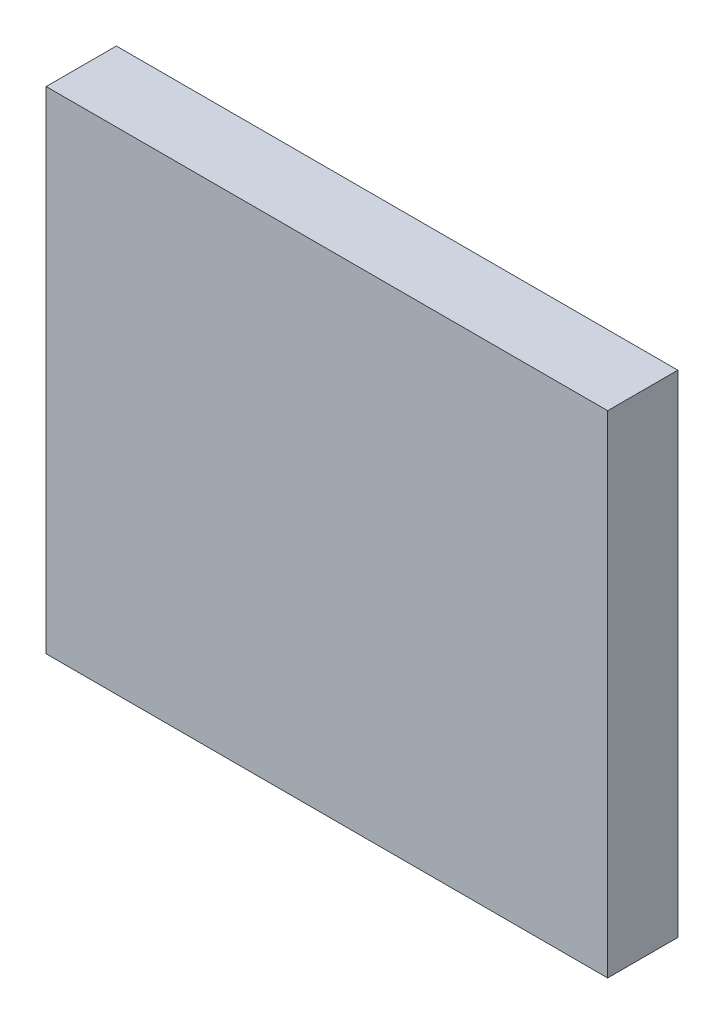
ISO-10303-21;
HEADER;
FILE_DESCRIPTION(('STEP AP214'),'2;1');
FILE_NAME('part.step','',(''),(''),'','','');
FILE_SCHEMA(('AUTOMOTIVE_DESIGN { 1 0 10303 214 1 1 1 1 }'));
ENDSEC;
DATA;
#1=APPLICATION_CONTEXT('core data for automotive mechanical design processes');
#2=APPLICATION_PROTOCOL_DEFINITION('international standard','automotive_design',2000,#1);
#3=PRODUCT_CONTEXT('',#1,'mechanical');
#4=PRODUCT('Part','Part','',(#3));
#5=PRODUCT_RELATED_PRODUCT_CATEGORY('part','',(#4));
#6=PRODUCT_DEFINITION_FORMATION('','',#4);
#7=PRODUCT_DEFINITION_CONTEXT('part definition',#1,'design');
#8=PRODUCT_DEFINITION('design','',#6,#7);
#9=PRODUCT_DEFINITION_SHAPE('','',#8);
#10=(LENGTH_UNIT() NAMED_UNIT(*) SI_UNIT(.MILLI.,.METRE.));
#11=(NAMED_UNIT(*) PLANE_ANGLE_UNIT() SI_UNIT($,.RADIAN.));
#12=(NAMED_UNIT(*) SI_UNIT($,.STERADIAN.) SOLID_ANGLE_UNIT());
#13=UNCERTAINTY_MEASURE_WITH_UNIT(LENGTH_MEASURE(1.E-05),#10,'distance_accuracy_value','');
#14=(GEOMETRIC_REPRESENTATION_CONTEXT(3) GLOBAL_UNCERTAINTY_ASSIGNED_CONTEXT((#13)) GLOBAL_UNIT_ASSIGNED_CONTEXT((#10,
#11,#12)) REPRESENTATION_CONTEXT('',''));
#15=CARTESIAN_POINT('',(0.,0.,0.));
#16=DIRECTION('',(0.,0.,1.));
#17=DIRECTION('',(1.,0.,0.));
#18=AXIS2_PLACEMENT_3D('',#15,#16,#17);
#19=CARTESIAN_POINT('',(8.,7.,2.));
#20=DIRECTION('',(-1.,0.,0.));
#21=DIRECTION('',(0.,0.,1.));
#22=AXIS2_PLACEMENT_3D('',#19,#20,#21);
#23=PLANE('',#22);
#24=DIRECTION('',(0.,1.,0.));
#25=VECTOR('',#24,1.);
#26=CARTESIAN_POINT('',(8.,7.,0.));
#27=LINE('',#26,#25);
#28=CARTESIAN_POINT('',(8.,-7.,0.));
#29=VERTEX_POINT('',#28);
#30=CARTESIAN_POINT('',(8.,7.,0.));
#31=VERTEX_POINT('',#30);
#32=EDGE_CURVE('E97',#29,#31,#27,.T.);
#33=ORIENTED_EDGE('',*,*,#32,.T.);
#34=DIRECTION('',(0.,0.,-1.));
#35=VECTOR('',#34,1.);
#36=CARTESIAN_POINT('',(8.,7.,2.));
#37=LINE('',#36,#35);
#38=CARTESIAN_POINT('',(8.,7.,2.));
#39=VERTEX_POINT('',#38);
#40=EDGE_CURVE('E11',#39,#31,#37,.T.);
#41=ORIENTED_EDGE('',*,*,#40,.F.);
#42=DIRECTION('',(0.,1.,0.));
#43=VECTOR('',#42,1.);
#44=CARTESIAN_POINT('',(8.,7.,2.));
#45=LINE('',#44,#43);
#46=CARTESIAN_POINT('',(8.,-7.,2.));
#47=VERTEX_POINT('',#46);
#48=EDGE_CURVE('E85',#47,#39,#45,.T.);
#49=ORIENTED_EDGE('',*,*,#48,.F.);
#50=DIRECTION('',(0.,0.,-1.));
#51=VECTOR('',#50,1.);
#52=CARTESIAN_POINT('',(8.,-7.,2.));
#53=LINE('',#52,#51);
#54=EDGE_CURVE('E93',#47,#29,#53,.T.);
#55=ORIENTED_EDGE('',*,*,#54,.T.);
#56=EDGE_LOOP('',(#33,#41,#49,#55));
#57=FACE_BOUND('',#56,.T.);
#58=ADVANCED_FACE('F34',(#57),#23,.F.);
#59=CARTESIAN_POINT('',(-8.,7.,2.));
#60=DIRECTION('',(0.,-1.,0.));
#61=DIRECTION('',(0.,0.,-1.));
#62=AXIS2_PLACEMENT_3D('',#59,#60,#61);
#63=PLANE('',#62);
#64=DIRECTION('',(-1.,0.,0.));
#65=VECTOR('',#64,1.);
#66=CARTESIAN_POINT('',(-8.,7.,0.));
#67=LINE('',#66,#65);
#68=CARTESIAN_POINT('',(-8.,7.,0.));
#69=VERTEX_POINT('',#68);
#70=EDGE_CURVE('E89',#31,#69,#67,.T.);
#71=ORIENTED_EDGE('',*,*,#70,.T.);
#72=DIRECTION('',(0.,0.,-1.));
#73=VECTOR('',#72,1.);
#74=CARTESIAN_POINT('',(-8.,7.,2.));
#75=LINE('',#74,#73);
#76=CARTESIAN_POINT('',(-8.,7.,2.));
#77=VERTEX_POINT('',#76);
#78=EDGE_CURVE('E42',#77,#69,#75,.T.);
#79=ORIENTED_EDGE('',*,*,#78,.F.);
#80=DIRECTION('',(-1.,0.,0.));
#81=VECTOR('',#80,1.);
#82=CARTESIAN_POINT('',(-8.,7.,2.));
#83=LINE('',#82,#81);
#84=EDGE_CURVE('E80',#39,#77,#83,.T.);
#85=ORIENTED_EDGE('',*,*,#84,.F.);
#86=ORIENTED_EDGE('',*,*,#40,.T.);
#87=EDGE_LOOP('',(#71,#79,#85,#86));
#88=FACE_BOUND('',#87,.T.);
#89=ADVANCED_FACE('F88',(#88),#63,.F.);
#90=CARTESIAN_POINT('',(-8.,7.,2.));
#91=DIRECTION('',(1.,0.,0.));
#92=DIRECTION('',(0.,0.,-1.));
#93=AXIS2_PLACEMENT_3D('',#90,#91,#92);
#94=PLANE('',#93);
#95=DIRECTION('',(0.,-1.,0.));
#96=VECTOR('',#95,1.);
#97=CARTESIAN_POINT('',(-8.,7.,0.));
#98=LINE('',#97,#96);
#99=CARTESIAN_POINT('',(-8.,-7.,0.));
#100=VERTEX_POINT('',#99);
#101=EDGE_CURVE('E67',#69,#100,#98,.T.);
#102=ORIENTED_EDGE('',*,*,#101,.T.);
#103=DIRECTION('',(0.,0.,-1.));
#104=VECTOR('',#103,1.);
#105=CARTESIAN_POINT('',(-8.,-7.,2.));
#106=LINE('',#105,#104);
#107=CARTESIAN_POINT('',(-8.,-7.,2.));
#108=VERTEX_POINT('',#107);
#109=EDGE_CURVE('E90',#108,#100,#106,.T.);
#110=ORIENTED_EDGE('',*,*,#109,.F.);
#111=DIRECTION('',(0.,-1.,0.));
#112=VECTOR('',#111,1.);
#113=CARTESIAN_POINT('',(-8.,7.,2.));
#114=LINE('',#113,#112);
#115=EDGE_CURVE('E83',#77,#108,#114,.T.);
#116=ORIENTED_EDGE('',*,*,#115,.F.);
#117=ORIENTED_EDGE('',*,*,#78,.T.);
#118=EDGE_LOOP('',(#102,#110,#116,#117));
#119=FACE_BOUND('',#118,.T.);
#120=ADVANCED_FACE('F91',(#119),#94,.F.);
#121=CARTESIAN_POINT('',(-8.,-7.,2.));
#122=DIRECTION('',(0.,1.,0.));
#123=DIRECTION('',(0.,0.,1.));
#124=AXIS2_PLACEMENT_3D('',#121,#122,#123);
#125=PLANE('',#124);
#126=DIRECTION('',(1.,0.,0.));
#127=VECTOR('',#126,1.);
#128=CARTESIAN_POINT('',(-8.,-7.,0.));
#129=LINE('',#128,#127);
#130=EDGE_CURVE('E73',#100,#29,#129,.T.);
#131=ORIENTED_EDGE('',*,*,#130,.T.);
#132=ORIENTED_EDGE('',*,*,#54,.F.);
#133=DIRECTION('',(1.,0.,0.));
#134=VECTOR('',#133,1.);
#135=CARTESIAN_POINT('',(-8.,-7.,2.));
#136=LINE('',#135,#134);
#137=EDGE_CURVE('E50',#108,#47,#136,.T.);
#138=ORIENTED_EDGE('',*,*,#137,.F.);
#139=ORIENTED_EDGE('',*,*,#109,.T.);
#140=EDGE_LOOP('',(#131,#132,#138,#139));
#141=FACE_BOUND('',#140,.T.);
#142=ADVANCED_FACE('F104',(#141),#125,.F.);
#143=CARTESIAN_POINT('',(0.,0.,2.));
#144=DIRECTION('',(0.,0.,1.));
#145=DIRECTION('',(1.,0.,0.));
#146=AXIS2_PLACEMENT_3D('',#143,#144,#145);
#147=PLANE('',#146);
#148=ORIENTED_EDGE('',*,*,#48,.T.);
#149=ORIENTED_EDGE('',*,*,#84,.T.);
#150=ORIENTED_EDGE('',*,*,#115,.T.);
#151=ORIENTED_EDGE('',*,*,#137,.T.);
#152=EDGE_LOOP('',(#148,#149,#150,#151));
#153=FACE_BOUND('',#152,.T.);
#154=ADVANCED_FACE('F81',(#153),#147,.T.);
#155=CARTESIAN_POINT('',(0.,0.,0.));
#156=DIRECTION('',(0.,0.,1.));
#157=DIRECTION('',(1.,0.,0.));
#158=AXIS2_PLACEMENT_3D('',#155,#156,#157);
#159=PLANE('',#158);
#160=ORIENTED_EDGE('',*,*,#32,.F.);
#161=ORIENTED_EDGE('',*,*,#130,.F.);
#162=ORIENTED_EDGE('',*,*,#101,.F.);
#163=ORIENTED_EDGE('',*,*,#70,.F.);
#164=EDGE_LOOP('',(#160,#161,#162,#163));
#165=FACE_BOUND('',#164,.T.);
#166=ADVANCED_FACE('F107',(#165),#159,.F.);
#167=CLOSED_SHELL('',(#58,#89,#120,#142,#154,#166));
#168=MANIFOLD_SOLID_BREP('B2',#167);
#169=ADVANCED_BREP_SHAPE_REPRESENTATION('',(#18,#168),#14);
#170=SHAPE_DEFINITION_REPRESENTATION(#9,#169);
ENDSEC;
END-ISO-10303-21;
